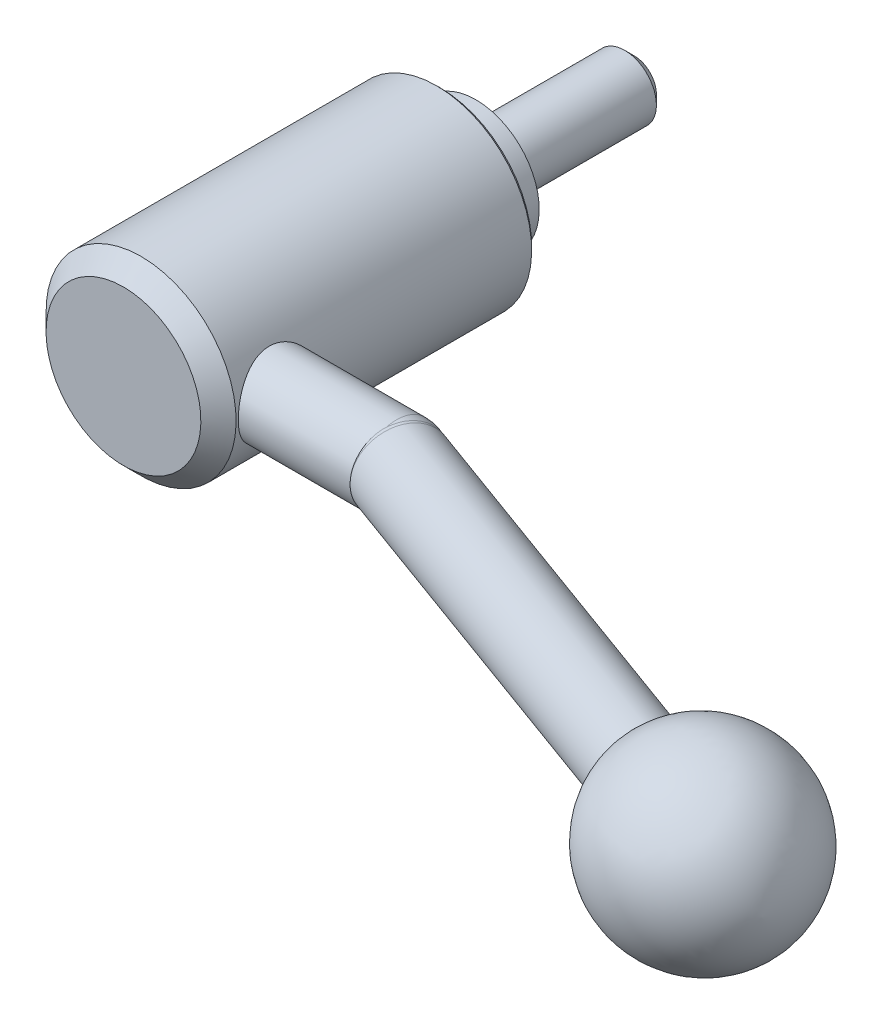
ISO-10303-21;
HEADER;
FILE_DESCRIPTION(('STEP AP214'),'2;1');
FILE_NAME('part.step','',(''),(''),'','','');
FILE_SCHEMA(('AUTOMOTIVE_DESIGN { 1 0 10303 214 1 1 1 1 }'));
ENDSEC;
DATA;
#1=APPLICATION_CONTEXT('core data for automotive mechanical design processes');
#2=APPLICATION_PROTOCOL_DEFINITION('international standard','automotive_design',2000,#1);
#3=PRODUCT_CONTEXT('',#1,'mechanical');
#4=PRODUCT('Part','Part','',(#3));
#5=PRODUCT_RELATED_PRODUCT_CATEGORY('part','',(#4));
#6=PRODUCT_DEFINITION_FORMATION('','',#4);
#7=PRODUCT_DEFINITION_CONTEXT('part definition',#1,'design');
#8=PRODUCT_DEFINITION('design','',#6,#7);
#9=PRODUCT_DEFINITION_SHAPE('','',#8);
#10=(LENGTH_UNIT() NAMED_UNIT(*) SI_UNIT(.MILLI.,.METRE.));
#11=(NAMED_UNIT(*) PLANE_ANGLE_UNIT() SI_UNIT($,.RADIAN.));
#12=(NAMED_UNIT(*) SI_UNIT($,.STERADIAN.) SOLID_ANGLE_UNIT());
#13=UNCERTAINTY_MEASURE_WITH_UNIT(LENGTH_MEASURE(1.E-05),#10,'distance_accuracy_value','');
#14=(GEOMETRIC_REPRESENTATION_CONTEXT(3) GLOBAL_UNCERTAINTY_ASSIGNED_CONTEXT((#13)) GLOBAL_UNIT_ASSIGNED_CONTEXT((#10,
#11,#12)) REPRESENTATION_CONTEXT('',''));
#15=CARTESIAN_POINT('',(0.,0.,0.));
#16=DIRECTION('',(0.,0.,1.));
#17=DIRECTION('',(1.,0.,0.));
#18=AXIS2_PLACEMENT_3D('',#15,#16,#17);
#19=CARTESIAN_POINT('',(0.,0.,-20.));
#20=DIRECTION('',(0.,0.,-1.));
#21=DIRECTION('',(0.,1.,0.));
#22=AXIS2_PLACEMENT_3D('',#19,#20,#21);
#23=CYLINDRICAL_SURFACE('',#22,12.);
#24=CARTESIAN_POINT('',(0.,0.,4.95));
#25=DIRECTION('',(0.,0.,-1.));
#26=DIRECTION('',(0.,1.,0.));
#27=AXIS2_PLACEMENT_3D('',#24,#25,#26);
#28=CIRCLE('',#27,12.);
#29=CARTESIAN_POINT('',(0.,12.,4.95));
#30=VERTEX_POINT('',#29);
#31=EDGE_CURVE('E141',#30,#30,#28,.T.);
#32=ORIENTED_EDGE('',*,*,#31,.F.);
#33=EDGE_LOOP('',(#32));
#34=FACE_BOUND('',#33,.T.);
#35=CARTESIAN_POINT('',(10.9087121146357,5.,37.));
#36=CARTESIAN_POINT('',(10.9087130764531,4.99999907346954,37.1334013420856));
#37=CARTESIAN_POINT('',(10.9111675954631,4.99465346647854,37.266850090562));
#38=CARTESIAN_POINT('',(10.9209052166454,4.97332510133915,37.5327768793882));
#39=CARTESIAN_POINT('',(10.9281914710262,4.95733539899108,37.6652542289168));
#40=CARTESIAN_POINT('',(10.94736464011,4.91485001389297,37.928469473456));
#41=CARTESIAN_POINT('',(10.9592613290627,4.88833200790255,38.0592030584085));
#42=CARTESIAN_POINT('',(10.9872633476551,4.82506361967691,38.3177583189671));
#43=CARTESIAN_POINT('',(11.0033704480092,4.7883089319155,38.4455787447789));
#44=CARTESIAN_POINT('',(11.0391992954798,4.7051161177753,38.6968536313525));
#45=CARTESIAN_POINT('',(11.0589043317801,4.65872262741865,38.8203252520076));
#46=CARTESIAN_POINT('',(11.1013893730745,4.5565572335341,39.062794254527));
#47=CARTESIAN_POINT('',(11.1241705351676,4.5007817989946,39.1817899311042));
#48=CARTESIAN_POINT('',(11.1961478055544,4.3200790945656,39.5308988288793));
#49=CARTESIAN_POINT('',(11.2490254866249,4.18166963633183,39.7534507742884));
#50=CARTESIAN_POINT('',(11.3622340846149,3.86388960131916,40.185337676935));
#51=CARTESIAN_POINT('',(11.4228172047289,3.68264836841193,40.3932181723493));
#52=CARTESIAN_POINT('',(11.5425773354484,3.28805127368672,40.7768129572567));
#53=CARTESIAN_POINT('',(11.6017537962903,3.07468308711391,40.9525148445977));
#54=CARTESIAN_POINT('',(11.6861172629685,2.72939811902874,41.1918033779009));
#55=CARTESIAN_POINT('',(11.7140370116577,2.60726265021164,41.2688525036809));
#56=CARTESIAN_POINT('',(11.7670757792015,2.35633907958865,41.4123143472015));
#57=CARTESIAN_POINT('',(11.7921959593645,2.22755376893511,41.4787314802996));
#58=CARTESIAN_POINT('',(11.838917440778,1.96416180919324,41.6003389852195));
#59=CARTESIAN_POINT('',(11.8605184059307,1.82955460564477,41.6555282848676));
#60=CARTESIAN_POINT('',(11.8995529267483,1.55556138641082,41.7540939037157));
#61=CARTESIAN_POINT('',(11.9169885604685,1.41617779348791,41.7974761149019));
#62=CARTESIAN_POINT('',(11.9463943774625,1.14097065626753,41.8700493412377));
#63=CARTESIAN_POINT('',(11.9586002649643,1.00533485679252,41.8998574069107));
#64=CARTESIAN_POINT('',(11.978450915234,0.731783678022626,41.9481078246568));
#65=CARTESIAN_POINT('',(11.9860977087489,0.593869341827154,41.9665552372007));
#66=CARTESIAN_POINT('',(11.9966178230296,0.316820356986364,41.9918906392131));
#67=CARTESIAN_POINT('',(11.9994918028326,0.177685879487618,41.998780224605));
#68=CARTESIAN_POINT('',(12.0003846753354,-0.100685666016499,42.0009233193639));
#69=CARTESIAN_POINT('',(11.9984037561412,-0.239922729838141,41.9961772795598));
#70=CARTESIAN_POINT('',(11.9899136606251,-0.508875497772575,41.9757519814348));
#71=CARTESIAN_POINT('',(11.9836886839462,-0.638652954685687,41.9607587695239));
#72=CARTESIAN_POINT('',(11.9671679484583,-0.896425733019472,41.9207154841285));
#73=CARTESIAN_POINT('',(11.9568708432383,-1.02442045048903,41.8956620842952));
#74=CARTESIAN_POINT('',(11.9324642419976,-1.27768058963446,41.8357474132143));
#75=CARTESIAN_POINT('',(11.9183560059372,-1.40294689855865,41.8008893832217));
#76=CARTESIAN_POINT('',(11.8866740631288,-1.65000960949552,41.7216867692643));
#77=CARTESIAN_POINT('',(11.8690990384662,-1.77180467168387,41.6773385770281));
#78=CARTESIAN_POINT('',(11.8112061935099,-2.1344060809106,41.5291317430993));
#79=CARTESIAN_POINT('',(11.7660875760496,-2.36878813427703,41.4109765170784));
#80=CARTESIAN_POINT('',(11.6674248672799,-2.81488765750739,41.1406025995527));
#81=CARTESIAN_POINT('',(11.6138778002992,-3.02659707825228,40.9883718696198));
#82=CARTESIAN_POINT('',(11.4992708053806,-3.4373466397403,40.6416848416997));
#83=CARTESIAN_POINT('',(11.4379473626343,-3.6344418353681,40.4450085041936));
#84=CARTESIAN_POINT('',(11.317506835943,-3.9937495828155,40.0211105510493));
#85=CARTESIAN_POINT('',(11.2583906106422,-4.15594867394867,39.7938772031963));
#86=CARTESIAN_POINT('',(11.1754830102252,-4.37204843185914,39.4302315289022));
#87=CARTESIAN_POINT('',(11.1484199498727,-4.44042007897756,39.3029580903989));
#88=CARTESIAN_POINT('',(11.0975376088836,-4.5660982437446,39.0424564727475));
#89=CARTESIAN_POINT('',(11.0737170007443,-4.62340929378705,38.9092307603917));
#90=CARTESIAN_POINT('',(11.0301558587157,-4.72639308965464,38.6377673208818));
#91=CARTESIAN_POINT('',(11.010413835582,-4.77207008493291,38.4995314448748));
#92=CARTESIAN_POINT('',(10.9757324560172,-4.85130620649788,38.219039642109));
#93=CARTESIAN_POINT('',(10.9607926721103,-4.88486641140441,38.0767840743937));
#94=CARTESIAN_POINT('',(10.9370969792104,-4.93768074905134,37.7987576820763));
#95=CARTESIAN_POINT('',(10.9280027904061,-4.95772169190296,37.6631648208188));
#96=CARTESIAN_POINT('',(10.9148523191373,-4.9866073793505,37.3905520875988));
#97=CARTESIAN_POINT('',(10.9107956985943,-4.99545287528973,37.2535323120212));
#98=CARTESIAN_POINT('',(10.9078699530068,-5.00183821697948,36.9792139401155));
#99=CARTESIAN_POINT('',(10.9089993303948,-4.9993813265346,36.8419154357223));
#100=CARTESIAN_POINT('',(10.9163998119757,-4.98320111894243,36.5681288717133));
#101=CARTESIAN_POINT('',(10.9226707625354,-4.96947813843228,36.4316407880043));
#102=CARTESIAN_POINT('',(10.939564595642,-4.93217158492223,36.1692842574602));
#103=CARTESIAN_POINT('',(10.9498816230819,-4.90927900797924,36.0432974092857));
#104=CARTESIAN_POINT('',(10.9744912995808,-4.85401305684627,35.7938045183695));
#105=CARTESIAN_POINT('',(10.9887852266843,-4.82163663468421,35.6702992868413));
#106=CARTESIAN_POINT('',(11.0370194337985,-4.71071065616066,35.3047320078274));
#107=CARTESIAN_POINT('',(11.0763259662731,-4.6183356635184,35.0674195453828));
#108=CARTESIAN_POINT('',(11.1668340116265,-4.39509042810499,34.6014982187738));
#109=CARTESIAN_POINT('',(11.2184687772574,-4.26275559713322,34.3736835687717));
#110=CARTESIAN_POINT('',(11.3271978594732,-3.9648148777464,33.9423843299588));
#111=CARTESIAN_POINT('',(11.3842945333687,-3.79919458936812,33.7389103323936));
#112=CARTESIAN_POINT('',(11.5031524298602,-3.42333828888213,33.344771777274));
#113=CARTESIAN_POINT('',(11.5649149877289,-3.21056780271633,33.1564985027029));
#114=CARTESIAN_POINT('',(11.652539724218,-2.86918502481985,32.9026870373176));
#115=CARTESIAN_POINT('',(11.6809270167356,-2.75160882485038,32.8228101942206));
#116=CARTESIAN_POINT('',(11.7352796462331,-2.50969002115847,32.6731475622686));
#117=CARTESIAN_POINT('',(11.761246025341,-2.38535036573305,32.6033574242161));
#118=CARTESIAN_POINT('',(11.8101156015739,-2.13027929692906,32.4742500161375));
#119=CARTESIAN_POINT('',(11.8330091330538,-1.99952940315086,32.4149656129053));
#120=CARTESIAN_POINT('',(11.8749794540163,-1.73293321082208,32.3077113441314));
#121=CARTESIAN_POINT('',(11.8940578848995,-1.59708913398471,32.2597366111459));
#122=CARTESIAN_POINT('',(11.9278439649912,-1.32129951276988,32.1755883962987));
#123=CARTESIAN_POINT('',(11.9425527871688,-1.18135508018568,32.1394117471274));
#124=CARTESIAN_POINT('',(11.9671605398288,-0.89845467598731,32.0792595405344));
#125=CARTESIAN_POINT('',(11.9770598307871,-0.75549893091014,32.0552830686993));
#126=CARTESIAN_POINT('',(11.9912289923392,-0.477883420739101,32.021064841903));
#127=CARTESIAN_POINT('',(11.9958449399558,-0.343344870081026,32.0099778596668));
#128=CARTESIAN_POINT('',(12.0005316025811,-0.073683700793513,31.9987215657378));
#129=CARTESIAN_POINT('',(12.0006007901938,0.0614390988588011,31.9985559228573));
#130=CARTESIAN_POINT('',(11.9961887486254,0.331106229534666,32.0091516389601));
#131=CARTESIAN_POINT('',(11.9917099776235,0.465650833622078,32.0199070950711));
#132=CARTESIAN_POINT('',(11.9783256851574,0.733261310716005,32.0522225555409));
#133=CARTESIAN_POINT('',(11.9694185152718,0.866326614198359,32.0737865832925));
#134=CARTESIAN_POINT('',(11.9478093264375,1.12521434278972,32.1265303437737));
#135=CARTESIAN_POINT('',(11.9352551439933,1.25112522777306,32.1573367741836));
#136=CARTESIAN_POINT('',(11.9065633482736,1.49981842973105,32.2284909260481));
#137=CARTESIAN_POINT('',(11.8904244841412,1.62259963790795,32.2688419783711));
#138=CARTESIAN_POINT('',(11.8371898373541,1.98503132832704,32.403699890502));
#139=CARTESIAN_POINT('',(11.7952573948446,2.21898154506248,32.5120551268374));
#140=CARTESIAN_POINT('',(11.700229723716,2.67613896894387,32.7679713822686));
#141=CARTESIAN_POINT('',(11.6467156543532,2.8983828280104,32.9170829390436));
#142=CARTESIAN_POINT('',(11.5348651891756,3.31565850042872,33.248014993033));
#143=CARTESIAN_POINT('',(11.4765270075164,3.51068016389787,33.4298476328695));
#144=CARTESIAN_POINT('',(11.3565857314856,3.88182487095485,33.835823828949));
#145=CARTESIAN_POINT('',(11.2950305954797,4.05575892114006,34.0620045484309));
#146=CARTESIAN_POINT('',(11.2086213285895,4.28644220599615,34.4218577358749));
#147=CARTESIAN_POINT('',(11.1807840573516,4.35834922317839,34.5453544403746));
#148=CARTESIAN_POINT('',(11.1279493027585,4.49153302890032,34.7985115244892));
#149=CARTESIAN_POINT('',(11.1029505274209,4.55281466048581,34.9281690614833));
#150=CARTESIAN_POINT('',(11.0567342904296,4.66392927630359,35.1921877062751));
#151=CARTESIAN_POINT('',(11.0354990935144,4.7138162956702,35.3265229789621));
#152=CARTESIAN_POINT('',(10.9974167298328,4.80199267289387,35.599492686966));
#153=CARTESIAN_POINT('',(10.9805674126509,4.84028771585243,35.7381249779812));
#154=CARTESIAN_POINT('',(10.9519122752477,4.90477948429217,36.0182918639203));
#155=CARTESIAN_POINT('',(10.9400931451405,4.93100815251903,36.1598177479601));
#156=CARTESIAN_POINT('',(10.9219030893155,4.97116941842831,36.4448760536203));
#157=CARTESIAN_POINT('',(10.9155279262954,4.98511157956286,36.5884068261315));
#158=CARTESIAN_POINT('',(10.9109028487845,4.99521783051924,36.7768518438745));
#159=CARTESIAN_POINT('',(10.9100818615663,4.99701063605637,36.8214567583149));
#160=CARTESIAN_POINT('',(10.9089863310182,4.99940188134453,36.9107060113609));
#161=CARTESIAN_POINT('',(10.9087117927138,5.00000031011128,36.9553503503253));
#162=CARTESIAN_POINT('',(10.9087121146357,5.,37.));
#163=B_SPLINE_CURVE_WITH_KNOTS('',3,(#35,#36,#37,#38,#39,#40,#41,#42,#43,#44,#45,#46,#47,#48,
#49,#50,#51,#52,#53,#54,#55,#56,#57,#58,#59,#60,#61,#62,#63,#64,#65,#66,#67,#68,#69,#70,#71,#72,
#73,#74,#75,#76,#77,#78,#79,#80,#81,#82,#83,#84,#85,#86,#87,#88,#89,#90,#91,#92,#93,#94,#95,#96,
#97,#98,#99,#100,#101,#102,#103,#104,#105,#106,#107,#108,#109,#110,#111,#112,#113,#114,#115,
#116,#117,#118,#119,#120,#121,#122,#123,#124,#125,#126,#127,#128,#129,#130,#131,#132,#133,#134,
#135,#136,#137,#138,#139,#140,#141,#142,#143,#144,#145,#146,#147,#148,#149,#150,#151,#152,#153,
#154,#155,#156,#157,#158,#159,#160,#161,#162),.UNSPECIFIED.,.T.,.F.,(4,2,2,2,2,2,2,2,2,2,2,2,2,
2,2,2,2,2,2,2,2,2,2,2,2,2,2,2,2,2,2,2,2,2,2,2,2,2,2,2,2,2,2,2,2,2,2,2,2,2,2,2,2,2,2,2,2,2,2,2,2,
2,2,4),(0.,0.400157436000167,0.800576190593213,1.20184852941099,1.60328989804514,
2.00291210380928,2.40268505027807,3.20123019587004,4.04483609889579,4.88876646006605,
5.32954710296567,5.77014421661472,6.21078338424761,6.65120225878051,7.06888225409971,
7.48637606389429,7.90381222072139,8.32123220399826,8.71313663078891,9.10517074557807,
9.49707541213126,9.88912935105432,10.6843842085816,11.4799204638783,12.3315328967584,
13.1834732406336,13.6239634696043,14.064272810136,14.5044210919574,14.9445301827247,
15.3560893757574,15.7676209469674,16.1790336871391,16.5904341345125,16.9753736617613,
17.3604370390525,18.129966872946,18.9320860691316,19.7345530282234,20.6023475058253,
21.0367677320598,21.4710000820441,21.9065678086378,22.3419477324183,22.7772106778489,
23.2124409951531,23.6171514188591,24.0219977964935,24.4266254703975,24.8314038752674,
25.2216396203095,25.6120117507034,26.3921129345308,27.2074696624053,28.0231295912,
28.8942922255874,29.3306260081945,29.7667603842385,30.2007814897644,30.6345893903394,
31.067242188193,31.4995579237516,31.6334900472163,31.7674234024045),.UNSPECIFIED.);
#164=CARTESIAN_POINT('',(10.9087121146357,5.,37.));
#165=VERTEX_POINT('',#164);
#166=EDGE_CURVE('E76',#165,#165,#163,.T.);
#167=ORIENTED_EDGE('',*,*,#166,.F.);
#168=EDGE_LOOP('',(#167));
#169=FACE_BOUND('',#168,.T.);
#170=CARTESIAN_POINT('',(0.,0.,42.275));
#171=DIRECTION('',(0.,0.,-1.));
#172=DIRECTION('',(0.,1.,0.));
#173=AXIS2_PLACEMENT_3D('',#170,#171,#172);
#174=CIRCLE('',#173,12.);
#175=CARTESIAN_POINT('',(0.,12.,42.275));
#176=VERTEX_POINT('',#175);
#177=EDGE_CURVE('E143',#176,#176,#174,.T.);
#178=ORIENTED_EDGE('',*,*,#177,.T.);
#179=EDGE_LOOP('',(#178));
#180=FACE_BOUND('',#179,.T.);
#181=ADVANCED_FACE('F14',(#34,#169,#180),#23,.T.);
#182=CARTESIAN_POINT('',(0.,0.,44.5));
#183=DIRECTION('',(0.,0.,-1.));
#184=DIRECTION('',(0.,1.,0.));
#185=AXIS2_PLACEMENT_3D('',#182,#183,#184);
#186=PLANE('',#185);
#187=CARTESIAN_POINT('',(0.,0.,44.5));
#188=DIRECTION('',(0.,0.,-1.));
#189=DIRECTION('',(0.,1.,0.));
#190=AXIS2_PLACEMENT_3D('',#187,#188,#189);
#191=CIRCLE('',#190,9.775);
#192=CARTESIAN_POINT('',(0.,9.775,44.5));
#193=VERTEX_POINT('',#192);
#194=EDGE_CURVE('E84',#193,#193,#191,.T.);
#195=ORIENTED_EDGE('',*,*,#194,.F.);
#196=EDGE_LOOP('',(#195));
#197=FACE_BOUND('',#196,.T.);
#198=ADVANCED_FACE('F60',(#197),#186,.F.);
#199=CARTESIAN_POINT('',(0.,0.,44.5));
#200=DIRECTION('',(0.,0.,-1.));
#201=DIRECTION('',(0.,1.,0.));
#202=AXIS2_PLACEMENT_3D('',#199,#200,#201);
#203=CONICAL_SURFACE('',#202,9.775,0.785398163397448);
#204=ORIENTED_EDGE('',*,*,#177,.F.);
#205=EDGE_LOOP('',(#204));
#206=FACE_BOUND('',#205,.T.);
#207=ORIENTED_EDGE('',*,*,#194,.T.);
#208=EDGE_LOOP('',(#207));
#209=FACE_BOUND('',#208,.T.);
#210=ADVANCED_FACE('F66',(#206,#209),#203,.T.);
#211=CARTESIAN_POINT('',(0.,0.,4.95));
#212=DIRECTION('',(0.,0.,1.));
#213=DIRECTION('',(0.,-1.,0.));
#214=AXIS2_PLACEMENT_3D('',#211,#212,#213);
#215=CONICAL_SURFACE('',#214,12.,0.785398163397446);
#216=CARTESIAN_POINT('',(0.,0.,4.5));
#217=DIRECTION('',(0.,0.,-1.));
#218=DIRECTION('',(0.,1.,0.));
#219=AXIS2_PLACEMENT_3D('',#216,#217,#218);
#220=CIRCLE('',#219,11.55);
#221=CARTESIAN_POINT('',(0.,11.55,4.5));
#222=VERTEX_POINT('',#221);
#223=EDGE_CURVE('E138',#222,#222,#220,.T.);
#224=ORIENTED_EDGE('',*,*,#223,.F.);
#225=EDGE_LOOP('',(#224));
#226=FACE_BOUND('',#225,.T.);
#227=ORIENTED_EDGE('',*,*,#31,.T.);
#228=EDGE_LOOP('',(#227));
#229=FACE_BOUND('',#228,.T.);
#230=ADVANCED_FACE('F73',(#226,#229),#215,.T.);
#231=CARTESIAN_POINT('',(11.55,0.,4.5));
#232=DIRECTION('',(0.,0.,1.));
#233=DIRECTION('',(0.,-1.,0.));
#234=AXIS2_PLACEMENT_3D('',#231,#232,#233);
#235=PLANE('',#234);
#236=CARTESIAN_POINT('',(0.,0.,4.5));
#237=DIRECTION('',(0.,0.,-1.));
#238=DIRECTION('',(0.,1.,0.));
#239=AXIS2_PLACEMENT_3D('',#236,#237,#238);
#240=CIRCLE('',#239,8.);
#241=CARTESIAN_POINT('',(0.,8.,4.5));
#242=VERTEX_POINT('',#241);
#243=EDGE_CURVE('E133',#242,#242,#240,.T.);
#244=ORIENTED_EDGE('',*,*,#243,.F.);
#245=EDGE_LOOP('',(#244));
#246=FACE_BOUND('',#245,.T.);
#247=ORIENTED_EDGE('',*,*,#223,.T.);
#248=EDGE_LOOP('',(#247));
#249=FACE_BOUND('',#248,.T.);
#250=ADVANCED_FACE('F155',(#246,#249),#235,.F.);
#251=CARTESIAN_POINT('',(0.,0.,-20.));
#252=DIRECTION('',(0.,0.,-1.));
#253=DIRECTION('',(0.,1.,0.));
#254=AXIS2_PLACEMENT_3D('',#251,#252,#253);
#255=CYLINDRICAL_SURFACE('',#254,8.);
#256=CARTESIAN_POINT('',(0.,0.,0.));
#257=DIRECTION('',(0.,0.,-1.));
#258=DIRECTION('',(0.,1.,0.));
#259=AXIS2_PLACEMENT_3D('',#256,#257,#258);
#260=CIRCLE('',#259,8.);
#261=CARTESIAN_POINT('',(0.,8.,0.));
#262=VERTEX_POINT('',#261);
#263=EDGE_CURVE('E129',#262,#262,#260,.T.);
#264=ORIENTED_EDGE('',*,*,#263,.F.);
#265=EDGE_LOOP('',(#264));
#266=FACE_BOUND('',#265,.T.);
#267=ORIENTED_EDGE('',*,*,#243,.T.);
#268=EDGE_LOOP('',(#267));
#269=FACE_BOUND('',#268,.T.);
#270=ADVANCED_FACE('F160',(#266,#269),#255,.T.);
#271=CARTESIAN_POINT('',(8.,0.,0.));
#272=DIRECTION('',(0.,0.,1.));
#273=DIRECTION('',(0.,-1.,0.));
#274=AXIS2_PLACEMENT_3D('',#271,#272,#273);
#275=PLANE('',#274);
#276=CARTESIAN_POINT('',(0.,0.,0.));
#277=DIRECTION('',(0.,0.,-1.));
#278=DIRECTION('',(0.,1.,0.));
#279=AXIS2_PLACEMENT_3D('',#276,#277,#278);
#280=CIRCLE('',#279,4.);
#281=CARTESIAN_POINT('',(0.,4.,0.));
#282=VERTEX_POINT('',#281);
#283=EDGE_CURVE('E127',#282,#282,#280,.T.);
#284=ORIENTED_EDGE('',*,*,#283,.F.);
#285=EDGE_LOOP('',(#284));
#286=FACE_BOUND('',#285,.T.);
#287=ORIENTED_EDGE('',*,*,#263,.T.);
#288=EDGE_LOOP('',(#287));
#289=FACE_BOUND('',#288,.T.);
#290=ADVANCED_FACE('F168',(#286,#289),#275,.F.);
#291=CARTESIAN_POINT('',(0.,0.,-20.));
#292=DIRECTION('',(0.,0.,-1.));
#293=DIRECTION('',(0.,1.,0.));
#294=AXIS2_PLACEMENT_3D('',#291,#292,#293);
#295=CYLINDRICAL_SURFACE('',#294,4.);
#296=CARTESIAN_POINT('',(0.,0.,-18.8));
#297=DIRECTION('',(0.,0.,1.));
#298=DIRECTION('',(0.,-1.,0.));
#299=AXIS2_PLACEMENT_3D('',#296,#297,#298);
#300=CIRCLE('',#299,4.);
#301=CARTESIAN_POINT('',(0.,-4.,-18.8));
#302=VERTEX_POINT('',#301);
#303=EDGE_CURVE('E9',#302,#302,#300,.T.);
#304=ORIENTED_EDGE('',*,*,#303,.T.);
#305=EDGE_LOOP('',(#304));
#306=FACE_BOUND('',#305,.T.);
#307=ORIENTED_EDGE('',*,*,#283,.T.);
#308=EDGE_LOOP('',(#307));
#309=FACE_BOUND('',#308,.T.);
#310=ADVANCED_FACE('F91',(#306,#309),#295,.T.);
#311=CARTESIAN_POINT('',(32.,0.,37.));
#312=DIRECTION('',(1.,0.,0.));
#313=DIRECTION('',(0.,1.,0.));
#314=AXIS2_PLACEMENT_3D('',#311,#312,#313);
#315=CYLINDRICAL_SURFACE('',#314,5.);
#316=CARTESIAN_POINT('',(27.0002,-4.83117434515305,38.2883145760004));
#317=CARTESIAN_POINT('',(26.9771151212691,-4.81425533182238,38.3517716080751));
#318=CARTESIAN_POINT('',(26.9549711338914,-4.79599919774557,38.4151983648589));
#319=CARTESIAN_POINT('',(26.9123130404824,-4.75682023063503,38.5417664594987));
#320=CARTESIAN_POINT('',(26.8917987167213,-4.73589775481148,38.6049078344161));
#321=CARTESIAN_POINT('',(26.8323357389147,-4.66915958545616,38.7935221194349));
#322=CARTESIAN_POINT('',(26.7954419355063,-4.61935429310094,38.9182563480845));
#323=CARTESIAN_POINT('',(26.7260075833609,-4.50939025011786,39.1641477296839));
#324=CARTESIAN_POINT('',(26.69346300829,-4.4492411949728,39.2853081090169));
#325=CARTESIAN_POINT('',(26.631969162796,-4.3188661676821,39.5230484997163));
#326=CARTESIAN_POINT('',(26.6030201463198,-4.2486394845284,39.6396281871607));
#327=CARTESIAN_POINT('',(26.5482810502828,-4.09859694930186,39.8670626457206));
#328=CARTESIAN_POINT('',(26.5224880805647,-4.01879000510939,39.9779226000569));
#329=CARTESIAN_POINT('',(26.4737060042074,-3.85000176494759,40.1931483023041));
#330=CARTESIAN_POINT('',(26.4507179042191,-3.76101719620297,40.2975117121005));
#331=CARTESIAN_POINT('',(26.4073462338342,-3.57452106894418,40.4988018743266));
#332=CARTESIAN_POINT('',(26.3869613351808,-3.47701390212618,40.595732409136));
#333=CARTESIAN_POINT('',(26.3486169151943,-3.27404367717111,40.7814771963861));
#334=CARTESIAN_POINT('',(26.330658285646,-3.16857771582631,40.8702884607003));
#335=CARTESIAN_POINT('',(26.2968878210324,-2.94931894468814,41.0399164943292));
#336=CARTESIAN_POINT('',(26.2810998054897,-2.83545204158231,41.1206422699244));
#337=CARTESIAN_POINT('',(26.2517972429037,-2.60111411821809,41.2724351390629));
#338=CARTESIAN_POINT('',(26.2382835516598,-2.48064063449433,41.3434985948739));
#339=CARTESIAN_POINT('',(26.2134747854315,-2.23400638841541,41.4753507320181));
#340=CARTESIAN_POINT('',(26.2021792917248,-2.10784670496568,41.5361413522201));
#341=CARTESIAN_POINT('',(26.1817528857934,-1.850678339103,41.6469996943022));
#342=CARTESIAN_POINT('',(26.1726227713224,-1.71966789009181,41.6970634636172));
#343=CARTESIAN_POINT('',(26.1565659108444,-1.45489437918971,41.7856658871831));
#344=CARTESIAN_POINT('',(26.1496212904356,-1.32116370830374,41.8242978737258));
#345=CARTESIAN_POINT('',(26.1378073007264,-1.05084556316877,41.8903082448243));
#346=CARTESIAN_POINT('',(26.1329387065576,-0.914257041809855,41.9176824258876));
#347=CARTESIAN_POINT('',(26.121432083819,-0.501829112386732,41.9825129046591));
#348=CARTESIAN_POINT('',(26.1178737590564,-0.223000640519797,42.0027862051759));
#349=CARTESIAN_POINT('',(26.1189625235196,0.332703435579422,41.9966121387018));
#350=CARTESIAN_POINT('',(26.1235681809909,0.609581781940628,41.9704006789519));
#351=CARTESIAN_POINT('',(26.1365918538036,1.01839236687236,41.8971560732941));
#352=CARTESIAN_POINT('',(26.1419571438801,1.15365429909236,41.8670594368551));
#353=CARTESIAN_POINT('',(26.1547482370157,1.42110904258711,41.7957866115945));
#354=CARTESIAN_POINT('',(26.162173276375,1.55330297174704,41.7546145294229));
#355=CARTESIAN_POINT('',(26.1791117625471,1.81374291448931,41.661488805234));
#356=CARTESIAN_POINT('',(26.1886259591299,1.94198749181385,41.6095312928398));
#357=CARTESIAN_POINT('',(26.2097731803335,2.19354456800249,41.4952682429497));
#358=CARTESIAN_POINT('',(26.2214054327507,2.3168588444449,41.4329664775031));
#359=CARTESIAN_POINT('',(26.2468425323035,2.55777038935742,41.2984703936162));
#360=CARTESIAN_POINT('',(26.2606478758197,2.67536634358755,41.2262738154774));
#361=CARTESIAN_POINT('',(26.2904898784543,2.90395912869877,41.0725891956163));
#362=CARTESIAN_POINT('',(26.3065257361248,3.01495830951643,40.991104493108));
#363=CARTESIAN_POINT('',(26.3410146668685,3.23022663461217,40.8189957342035));
#364=CARTESIAN_POINT('',(26.3594803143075,3.33445623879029,40.7283247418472));
#365=CARTESIAN_POINT('',(26.3988776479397,3.53478388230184,40.5389677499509));
#366=CARTESIAN_POINT('',(26.4198084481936,3.63088482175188,40.440284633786));
#367=CARTESIAN_POINT('',(26.4643216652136,3.81440211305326,40.2356199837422));
#368=CARTESIAN_POINT('',(26.4879053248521,3.90181435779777,40.1296350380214));
#369=CARTESIAN_POINT('',(26.5379464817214,4.06730764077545,39.9113164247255));
#370=CARTESIAN_POINT('',(26.564402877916,4.14539223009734,39.7989851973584));
#371=CARTESIAN_POINT('',(26.6190846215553,4.28799916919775,39.5748364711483));
#372=CARTESIAN_POINT('',(26.6471479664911,4.35301377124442,39.463292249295));
#373=CARTESIAN_POINT('',(26.7066083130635,4.47390595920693,39.2362277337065));
#374=CARTESIAN_POINT('',(26.7380049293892,4.52978459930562,39.1207079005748));
#375=CARTESIAN_POINT('',(26.8047544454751,4.63216753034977,38.8866145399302));
#376=CARTESIAN_POINT('',(26.8401091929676,4.67866741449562,38.7680396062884));
#377=CARTESIAN_POINT('',(26.915981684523,4.76212497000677,38.529146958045));
#378=CARTESIAN_POINT('',(26.9565014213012,4.79907894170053,38.4088285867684));
#379=CARTESIAN_POINT('',(27.000199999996,4.8311743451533,38.2883145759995));
#380=B_SPLINE_CURVE_WITH_KNOTS('',3,(#316,#317,#318,#319,#320,#321,#322,#323,#324,#325,#326,
#327,#328,#329,#330,#331,#332,#333,#334,#335,#336,#337,#338,#339,#340,#341,#342,#343,#344,#345,
#346,#347,#348,#349,#350,#351,#352,#353,#354,#355,#356,#357,#358,#359,#360,#361,#362,#363,#364,
#365,#366,#367,#368,#369,#370,#371,#372,#373,#374,#375,#376,#377,#378,#379),.UNSPECIFIED.,.F.,
.F.,(4,2,2,2,2,2,2,2,2,2,2,2,2,2,2,2,2,2,2,2,2,2,2,2,2,2,2,2,2,2,2,4),(0.,0.208793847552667,
0.417559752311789,0.834859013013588,1.25176923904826,1.66870889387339,2.08526383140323,
2.50196783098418,2.91845835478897,3.33510154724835,3.75600341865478,4.17706331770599,
4.5980436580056,5.01917885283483,5.43677439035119,5.85452571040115,6.68900674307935,
7.51926494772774,7.93487433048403,8.35032982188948,8.76593465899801,9.18138827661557,
9.59693693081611,10.0123366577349,10.4299775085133,10.8474687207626,11.2651563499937,
11.6826844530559,12.078641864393,12.4745535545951,12.870650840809,13.2669014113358),.UNSPECIFIED.);
#381=CARTESIAN_POINT('',(27.,-4.83102779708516,38.2888640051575));
#382=VERTEX_POINT('',#381);
#383=CARTESIAN_POINT('',(26.1183650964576,0.,42.));
#384=VERTEX_POINT('',#383);
#385=EDGE_CURVE('E29',#382,#384,#380,.T.);
#386=ORIENTED_EDGE('',*,*,#385,.T.);
#387=CARTESIAN_POINT('',(27.,4.83102779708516,38.2888640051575));
#388=VERTEX_POINT('',#387);
#389=EDGE_CURVE('E96',#384,#388,#380,.T.);
#390=ORIENTED_EDGE('',*,*,#389,.T.);
#391=CARTESIAN_POINT('',(27.,0.,37.));
#392=DIRECTION('',(1.,0.,0.));
#393=DIRECTION('',(0.,1.,0.));
#394=AXIS2_PLACEMENT_3D('',#391,#392,#393);
#395=CIRCLE('',#394,5.);
#396=EDGE_CURVE('E105',#382,#388,#395,.T.);
#397=ORIENTED_EDGE('',*,*,#396,.F.);
#398=EDGE_LOOP('',(#386,#390,#397));
#399=FACE_BOUND('',#398,.T.);
#400=ORIENTED_EDGE('',*,*,#166,.T.);
#401=EDGE_LOOP('',(#400));
#402=FACE_BOUND('',#401,.T.);
#403=ADVANCED_FACE('F86',(#399,#402),#315,.T.);
#404=CARTESIAN_POINT('',(27.,0.,37.));
#405=DIRECTION('',(1.,0.,0.));
#406=DIRECTION('',(0.,0.,1.));
#407=AXIS2_PLACEMENT_3D('',#404,#405,#406);
#408=SPHERICAL_SURFACE('',#407,5.);
#409=CARTESIAN_POINT('',(27.4142329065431,0.,37.1507684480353));
#410=DIRECTION('',(0.939692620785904,0.,0.342020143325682));
#411=DIRECTION('',(-0.342020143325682,0.,0.939692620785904));
#412=AXIS2_PLACEMENT_3D('',#409,#410,#411);
#413=CIRCLE('',#412,4.98053008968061);
#414=EDGE_CURVE('E36',#382,#388,#413,.T.);
#415=ORIENTED_EDGE('',*,*,#414,.F.);
#416=ORIENTED_EDGE('',*,*,#396,.T.);
#417=EDGE_LOOP('',(#415,#416));
#418=FACE_BOUND('',#417,.T.);
#419=ADVANCED_FACE('F90',(#418),#408,.T.);
#420=CARTESIAN_POINT('',(27.828465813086,0.,37.3015368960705));
#421=DIRECTION('',(0.939692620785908,0.,0.342020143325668));
#422=DIRECTION('',(-0.342020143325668,0.,0.939692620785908));
#423=AXIS2_PLACEMENT_3D('',#420,#421,#422);
#424=SPHERICAL_SURFACE('',#423,5.);
#425=ORIENTED_EDGE('',*,*,#385,.F.);
#426=ORIENTED_EDGE('',*,*,#414,.T.);
#427=ORIENTED_EDGE('',*,*,#389,.F.);
#428=CARTESIAN_POINT('',(27.8284658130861,0.,37.3015368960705));
#429=DIRECTION('',(0.939692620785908,0.,0.342020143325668));
#430=DIRECTION('',(-0.342020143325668,0.,0.939692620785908));
#431=AXIS2_PLACEMENT_3D('',#428,#429,#430);
#432=CIRCLE('',#431,5.);
#433=EDGE_CURVE('E103',#384,#384,#432,.T.);
#434=ORIENTED_EDGE('',*,*,#433,.F.);
#435=EDGE_LOOP('',(#425,#426,#427,#434));
#436=FACE_BOUND('',#435,.T.);
#437=ADVANCED_FACE('F107',(#436),#424,.T.);
#438=CARTESIAN_POINT('',(99.5041035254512,0.,63.3893355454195));
#439=DIRECTION('',(0.939692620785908,0.,0.342020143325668));
#440=DIRECTION('',(-0.342020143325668,0.,0.939692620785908));
#441=AXIS2_PLACEMENT_3D('',#438,#439,#440);
#442=CYLINDRICAL_SURFACE('',#441,5.);
#443=CARTESIAN_POINT('',(78.3773961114,0.,55.6998428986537));
#444=DIRECTION('',(0.939692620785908,0.,0.342020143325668));
#445=DIRECTION('',(-0.342020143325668,0.,0.939692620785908));
#446=AXIS2_PLACEMENT_3D('',#443,#444,#445);
#447=CIRCLE('',#446,5.);
#448=CARTESIAN_POINT('',(76.6672953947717,0.,60.3983060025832));
#449=VERTEX_POINT('',#448);
#450=EDGE_CURVE('E119',#449,#449,#447,.T.);
#451=ORIENTED_EDGE('',*,*,#450,.F.);
#452=EDGE_LOOP('',(#451));
#453=FACE_BOUND('',#452,.T.);
#454=ORIENTED_EDGE('',*,*,#433,.T.);
#455=EDGE_LOOP('',(#454));
#456=FACE_BOUND('',#455,.T.);
#457=ADVANCED_FACE('F55',(#453,#456),#442,.T.);
#458=CARTESIAN_POINT('',(76.6672953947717,0.,60.3983060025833));
#459=DIRECTION('',(0.939692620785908,0.,0.342020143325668));
#460=DIRECTION('',(-0.342020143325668,0.,0.939692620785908));
#461=AXIS2_PLACEMENT_3D('',#458,#459,#460);
#462=PLANE('',#461);
#463=CARTESIAN_POINT('',(78.3773961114,0.,55.6998428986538));
#464=DIRECTION('',(0.939692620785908,0.,0.342020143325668));
#465=DIRECTION('',(-0.342020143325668,0.,0.939692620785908));
#466=AXIS2_PLACEMENT_3D('',#463,#464,#465);
#467=CIRCLE('',#466,6.84016260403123);
#468=CARTESIAN_POINT('',(76.0379227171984,0.,62.1274932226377));
#469=VERTEX_POINT('',#468);
#470=EDGE_CURVE('E122',#469,#469,#467,.T.);
#471=ORIENTED_EDGE('',*,*,#470,.F.);
#472=EDGE_LOOP('',(#471));
#473=FACE_BOUND('',#472,.T.);
#474=ORIENTED_EDGE('',*,*,#450,.T.);
#475=EDGE_LOOP('',(#474));
#476=FACE_BOUND('',#475,.T.);
#477=ADVANCED_FACE('F45',(#473,#476),#462,.F.);
#478=CARTESIAN_POINT('',(88.,0.,58.5));
#479=DIRECTION('',(0.,0.999999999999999,0.));
#480=DIRECTION('',(-0.342020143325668,0.,0.939692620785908));
#481=AXIS2_PLACEMENT_3D('',#478,#479,#480);
#482=CIRCLE('',#481,12.5);
#483=TRIMMED_CURVE('',#482,(PARAMETER_VALUE(-1.51798478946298)),
(PARAMETER_VALUE(1.51798478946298)),.T.,.PARAMETER.);
#484=CARTESIAN_POINT('',(87.7743223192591,0.,59.1200443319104));
#485=DIRECTION('',(0.939692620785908,0.,0.342020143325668));
#486=AXIS1_PLACEMENT('',#484,#485);
#487=SURFACE_OF_REVOLUTION('',#483,#486);
#488=ORIENTED_EDGE('',*,*,#470,.T.);
#489=EDGE_LOOP('',(#488));
#490=FACE_BOUND('',#489,.T.);
#491=CARTESIAN_POINT('',(99.5041035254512,0.,63.3893355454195));
#492=VERTEX_POINT('',#491);
#493=VERTEX_LOOP('',#492);
#494=FACE_BOUND('',#493,.T.);
#495=ADVANCED_FACE('F42',(#490,#494),#487,.T.);
#496=CARTESIAN_POINT('',(3.233,0.,-20.));
#497=DIRECTION('',(0.,0.,1.));
#498=DIRECTION('',(0.,-1.,0.));
#499=AXIS2_PLACEMENT_3D('',#496,#497,#498);
#500=PLANE('',#499);
#501=CARTESIAN_POINT('',(0.,0.,-20.));
#502=DIRECTION('',(0.,0.,1.));
#503=DIRECTION('',(0.,-1.,0.));
#504=AXIS2_PLACEMENT_3D('',#501,#502,#503);
#505=CIRCLE('',#504,2.8);
#506=CARTESIAN_POINT('',(0.,-2.8,-20.));
#507=VERTEX_POINT('',#506);
#508=EDGE_CURVE('E22',#507,#507,#505,.F.);
#509=ORIENTED_EDGE('',*,*,#508,.T.);
#510=EDGE_LOOP('',(#509));
#511=FACE_BOUND('',#510,.T.);
#512=ADVANCED_FACE('F44',(#511),#500,.F.);
#513=CARTESIAN_POINT('',(0.,0.,-20.));
#514=DIRECTION('',(0.,0.,1.));
#515=DIRECTION('',(0.,-1.,0.));
#516=AXIS2_PLACEMENT_3D('',#513,#514,#515);
#517=CONICAL_SURFACE('',#516,2.8,0.785398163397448);
#518=ORIENTED_EDGE('',*,*,#303,.F.);
#519=EDGE_LOOP('',(#518));
#520=FACE_BOUND('',#519,.T.);
#521=ORIENTED_EDGE('',*,*,#508,.F.);
#522=EDGE_LOOP('',(#521));
#523=FACE_BOUND('',#522,.T.);
#524=ADVANCED_FACE('F16',(#520,#523),#517,.T.);
#525=CLOSED_SHELL('',(#181,#198,#210,#230,#250,#270,#290,#310,#403,#419,#437,#457,#477,#495,
#512,#524));
#526=MANIFOLD_SOLID_BREP('B1',#525);
#527=ADVANCED_BREP_SHAPE_REPRESENTATION('',(#18,#526),#14);
#528=SHAPE_DEFINITION_REPRESENTATION(#9,#527);
ENDSEC;
END-ISO-10303-21;
